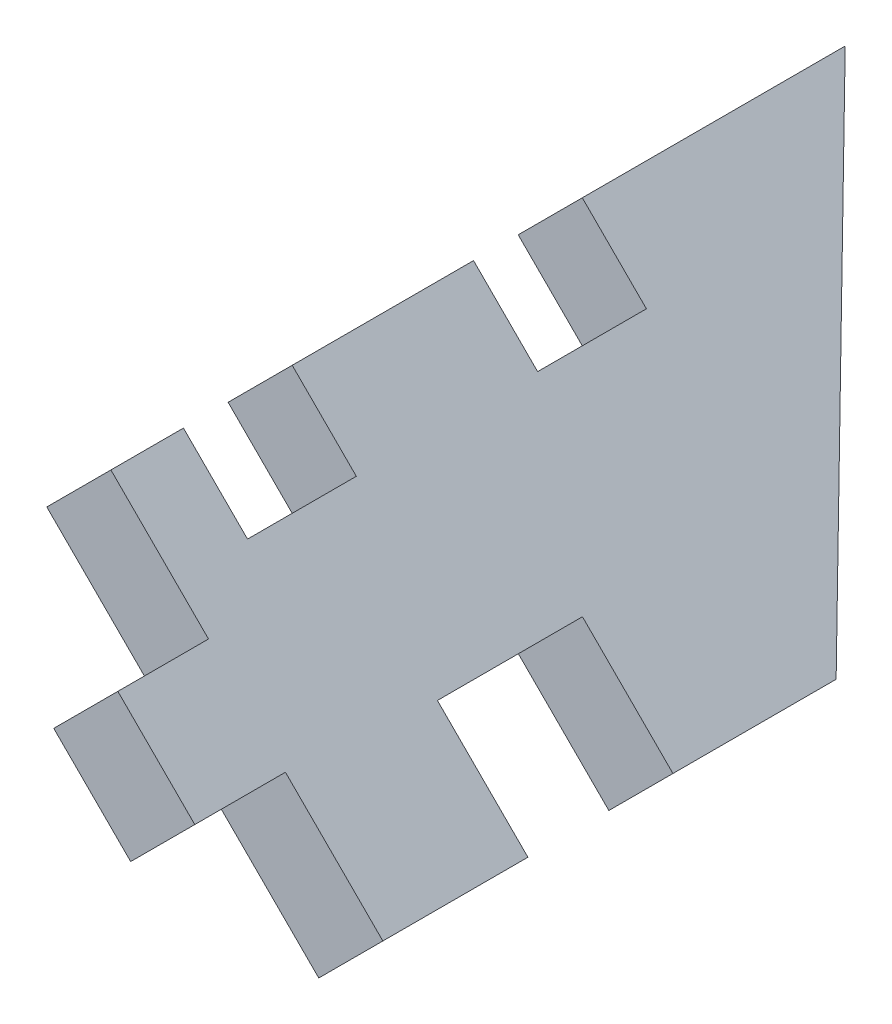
from build123d import *

# Parameters (mm, degrees)
SKETCH3_W           = 7.62
SKETCH3_H           = 6.35
BOSS_EXTRUDE4_DEPTH = 6.35
SKETCH9_W           = 7.62
SKETCH9_H           = 6.35
SKETCH9_W_2         = 10.16
SKETCH9_H_2         = 8.9662
CUT_EXTRUDE2_DEPTH  = 101.6


with BuildPart() as part:
    # Sketch3 → Boss-Extrude4 (new body)
    with BuildSketch(Plane(origin=(0, 0, 0), x_dir=(0.7071067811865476, -0.7071067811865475, 0), z_dir=(0.7071067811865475, 0.7071067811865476, 0))):
        Polygon((-26.940768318, 51.435), (0, 31.75), (0, 0), (-26.940768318, 0), align=None)
        with Locations((-13.462, -3.175)):
            Rectangle(SKETCH3_W, SKETCH3_H)
    extrude(amount=BOSS_EXTRUDE4_DEPTH)

    # Sketch9 → Cut-Extrude2 (cut)
    with BuildSketch(Plane(origin=(4.490128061, 4.490128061, 0), x_dir=(0, 0, -1), z_dir=(0.7071067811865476, 0.7071067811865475, 0))):
        with Locations((8.89, 23.765768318)):
            Rectangle(SKETCH9_W, SKETCH9_H)
        with Locations((29.21, 23.765768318)):
            Rectangle(SKETCH9_W, SKETCH9_H)
        with Locations((15.24, 4.4831)):
            Rectangle(SKETCH9_W_2, SKETCH9_H_2)
    extrude(amount=-CUT_EXTRUDE2_DEPTH, mode=Mode.SUBTRACT)


solid = part.part
